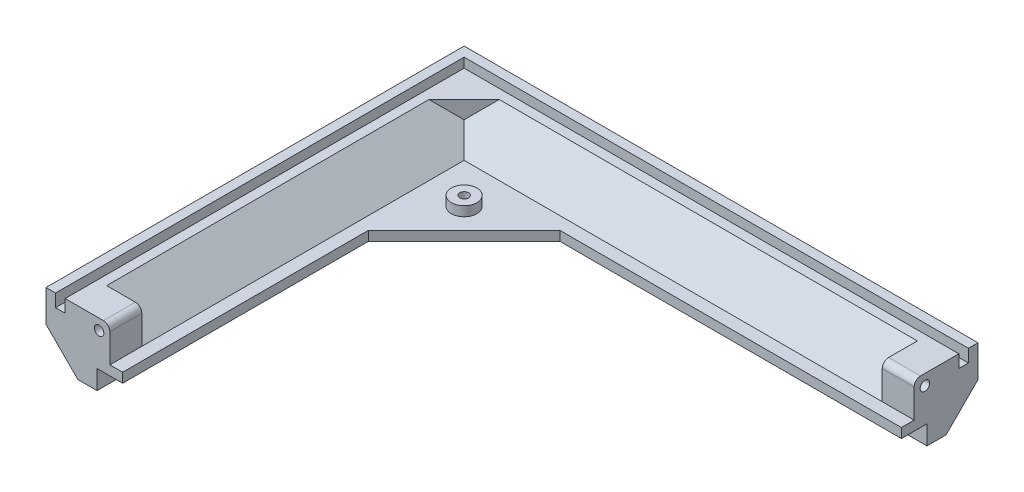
from build123d import *

# Parameters (mm, degrees)
BOSS_EXTRUDE2_DEPTH  = 111
BOSS_EXTRUDE3_DEPTH  = 141
SKETCH17_W           = 20
SKETCH17_H           = 20
BOSS_EXTRUDE9_DEPTH  = 20
SKETCH8_W            = 4
SKETCH8_H            = 3
CUT_EXTRUDE4_DEPTH   = 4
SKETCH9_W            = 3
SKETCH9_H            = 4
CUT_EXTRUDE5_DEPTH   = 17
SKETCH18_W           = 3
SKETCH18_H           = 4
CUT_EXTRUDE9_DEPTH   = 14
CUT_EXTRUDE7_DEPTH   = 11
BOSS_EXTRUDE5_DEPTH  = 10
BOSS_EXTRUDE6_DEPTH  = 10
CUT_EXTRUDE8_DEPTH   = 156.87104691
SKETCH15_W           = 141
SKETCH15_H           = 3
BOSS_EXTRUDE7_DEPTH  = 4
SKETCH16_W           = 107
SKETCH16_H           = 3
BOSS_EXTRUDE8_DEPTH  = 4
CHAMFER1_SIZE        = 30
CUT_EXTRUDE10_DEPTH  = 185.657709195
CUT_EXTRUDE11_DEPTH  = 152.361533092
CHAMFER2_SIZE        = 20
SKETCH21_R           = 1.4
CUT_EXTRUDE12_DEPTH  = 10
SKETCH22_R           = 1.5
BOSS_EXTRUDE10_DEPTH = 10
SKETCH23_R           = 1.5
BOSS_EXTRUDE11_DEPTH = 10
FILLET1_R            = 2
ESQUISSE1_R          = 4
ESQUISSE1_R_2        = 1.4
BOSS_EXTRU_1_DEPTH   = 3


with BuildPart() as part:
    # Sketch2 → Boss-Extrude2 (new body)
    with BuildSketch(Plane.XY.offset(6.547733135)):
        Polygon((-60.05786955, -10), (-60.05786955, 0), (-57.05786955, 0), (-57.05786955, -4), (-54.05786955, -4), (-54.05786955, 0), (-51.05786955, 0), (-40.05786955, -11), (-40.05786955, -14), (-44.05786955, -14), (-44.05786955, -17), (-40.05786955, -17), (-40.05786955, -20), (-50.05786955, -20), align=None)
    extrude(amount=BOSS_EXTRUDE2_DEPTH)



with BuildPart() as body_2:
    # Sketch3 → Boss-Extrude3 (new body)
    with BuildSketch(Plane(origin=(-40.05786955, 0, 0), x_dir=(0, 0, -1), z_dir=(1, 0, 0))):
        Polygon((-6.547733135, -14), (-2.547733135, -14), (-2.547733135, -17), (-6.547733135, -17), (-6.547733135, -20), (3.452266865, -20), (13.452266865, -10), (13.452266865, 0), (10.452266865, 0), (10.452266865, -4), (7.452266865, -4), (7.452266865, 0), (4.452266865, 0), (-6.547733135, -11), align=None)
    extrude(amount=BOSS_EXTRUDE3_DEPTH)


with BuildPart() as part_1:
    add(part.part)

    add(body_2.part)  # Boss-Extrude9 merges body 2
    # Sketch17 → Boss-Extrude9 (add)
    with BuildSketch(Plane(origin=(0, 0, 0), x_dir=(1, 0, 0), z_dir=(0, 1, 0))):
        with Locations((-50.05786955, 3.452266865)):
            Rectangle(SKETCH17_W, SKETCH17_H)
    extrude(amount=-BOSS_EXTRUDE9_DEPTH)

    # Sketch8 → Cut-Extrude4 (cut)
    with BuildSketch(Plane(origin=(-40.05786955, 0, 0), x_dir=(0, 0, -1), z_dir=(1, 0, 0))):
        with Locations((-4.547733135, -15.5)):
            Rectangle(SKETCH8_W, SKETCH8_H)
    extrude(amount=-CUT_EXTRUDE4_DEPTH, mode=Mode.SUBTRACT)

    # Sketch9 → Cut-Extrude5 (cut)
    with BuildSketch(Plane(origin=(-40.05786955, 0, 0), x_dir=(0, 0, -1), z_dir=(1, 0, 0))):
        with Locations((8.952266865, -2)):
            Rectangle(SKETCH9_W, SKETCH9_H)
    extrude(amount=-CUT_EXTRUDE5_DEPTH, mode=Mode.SUBTRACT)

    # Sketch18 → Cut-Extrude9 (cut)
    with BuildSketch(Plane.XY.offset(6.547733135)):
        with Locations((-55.55786955, -2)):
            Rectangle(SKETCH18_W, SKETCH18_H)
    extrude(amount=-CUT_EXTRUDE9_DEPTH, mode=Mode.SUBTRACT)

    # Sketch11 → Cut-Extrude7 (cut)
    with BuildSketch(Plane(origin=(0, 0, 0), x_dir=(1, 0, 0), z_dir=(0, 1, 0))):
        Polygon((-51.05786955, -6.547733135), (-40.05786955, 4.452266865), (-40.05786955, -6.547733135), align=None)
    extrude(amount=-CUT_EXTRUDE7_DEPTH, mode=Mode.SUBTRACT)

    # Sketch12 → Boss-Extrude5 (add)
    with BuildSketch(Plane.ZY.offset(40.05786955)):
        Polygon((6.547733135, -11), (-4.452266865, -11), (-4.452266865, 0), align=None)
    extrude(amount=BOSS_EXTRUDE5_DEPTH)

    # Sketch13 → Boss-Extrude6 (add)
    with BuildSketch(Plane(origin=(0, 0, 6.547733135), x_dir=(-1, 0, 0), z_dir=(0, 0, -1))):
        Polygon((40.05786955, -11), (51.05786955, -11), (51.05786955, 0), align=None)
    extrude(amount=BOSS_EXTRUDE6_DEPTH)

    # Sketch14 → Cut-Extrude8 (cut, through all)
    with BuildSketch(Plane(origin=(0, -17, 0), x_dir=(1, 0, 0), z_dir=(0, 1, 0))):
        Polygon((-44.05786955, -2.547733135), (-44.05786955, -147.547733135), (-40.05786955, -147.547733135), (-40.05786955, -6.547733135), (100.94213045, -6.547733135), (100.94213045, -2.547733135), align=None)
    extrude(amount=-CUT_EXTRUDE8_DEPTH, mode=Mode.SUBTRACT)

    # Sketch15 → Boss-Extrude7 (add)
    with BuildSketch(Plane.XY.offset(6.547733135)):
        with Locations((30.44213045, -12.5)):
            Rectangle(SKETCH15_W, SKETCH15_H)
    extrude(amount=BOSS_EXTRUDE7_DEPTH)

    # Sketch16 → Boss-Extrude8 (add)
    with BuildSketch(Plane(origin=(-40.05786955, 0, 0), x_dir=(0, 0, -1), z_dir=(1, 0, 0))):
        with Locations((-64.047733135, -12.5)):
            Rectangle(SKETCH16_W, SKETCH16_H)
    extrude(amount=BOSS_EXTRUDE8_DEPTH)

    # Chamfer1
    chamfer1_edges = [part_1.edges().sort_by_distance(p)[0] for p in [
        (-36.05786955, -12.5, 10.547733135),
    ]]
    chamfer(chamfer1_edges, length=CHAMFER1_SIZE)

    # Sketch19 → Cut-Extrude10 (cut, through all)
    with BuildSketch(Plane(origin=(-40.05786955, 0, 0), x_dir=(0, 0, -1), z_dir=(1, 0, 0))):
        Polygon((13.452266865, -10), (3.452266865, -20), (13.452266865, -20), align=None)
    extrude(amount=-CUT_EXTRUDE10_DEPTH, mode=Mode.SUBTRACT)

    # Sketch20 → Cut-Extrude11 (cut, through all)
    with BuildSketch(Plane.XY.offset(6.547733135)):
        Polygon((-50.05786955, -20), (-60.05786955, -10), (-60.05786955, -20), align=None)
    extrude(amount=-CUT_EXTRUDE11_DEPTH, mode=Mode.SUBTRACT)

    # Chamfer2
    chamfer2_edges = [part_1.edges().sort_by_distance(p)[0] for p in [
        (-44.05786955, -17, 2.547733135),
    ]]
    chamfer(chamfer2_edges, length=CHAMFER2_SIZE)

    # Sketch21 → Cut-Extrude12 (cut)
    with BuildSketch(Plane.XZ.offset(14)):
        with Locations(Location((-27.55786955, 19.047733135, 0), (0, 0, 270))):
            Circle(SKETCH21_R)
    extrude(amount=-CUT_EXTRUDE12_DEPTH, mode=Mode.SUBTRACT)

    # Sketch22 → Boss-Extrude10 (add)
    with BuildSketch(Plane(origin=(100.94213045, 0, 0), x_dir=(0, 0, -1), z_dir=(1, 0, 0))):
        Polygon((4.452266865, 0), (-6.547733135, -11), (-6.547733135, 0), align=None)
        with Locations((-3.169053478, -3.378679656)):
            Circle(SKETCH22_R, mode=Mode.SUBTRACT)
    extrude(amount=-BOSS_EXTRUDE10_DEPTH)

    # Sketch23 → Boss-Extrude11 (add)
    with BuildSketch(Plane.XY.offset(117.547733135)):
        Polygon((-51.05786955, 0), (-40.05786955, -11), (-40.05786955, 0), align=None)
        with Locations((-43.436549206, -3.378679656)):
            Circle(SKETCH23_R, mode=Mode.SUBTRACT)
    extrude(amount=-BOSS_EXTRUDE11_DEPTH)

    # Fillet1
    fillet1_edges = [part_1.edges().sort_by_distance(p)[0] for p in [
        (95.94213045, 0, 6.547733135),
        (-40.05786955, 0, 112.547733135),
    ]]
    fillet(fillet1_edges, radius=FILLET1_R)

    # Esquisse1 → Boss.-Extru.1 (add)
    with BuildSketch(Plane(origin=(0, -11, 0), x_dir=(1, 0, 0), z_dir=(0, 1, 0))):
        with Locations(Location((-27.55786955, -19.047733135, 0), (0, 0, 90))):
            Circle(ESQUISSE1_R)
        with Locations(Location((-27.55786955, -19.047733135, 0), (0, 0, 90))):
            Circle(ESQUISSE1_R_2, mode=Mode.SUBTRACT)
    extrude(amount=BOSS_EXTRU_1_DEPTH)


solid = part_1.part
